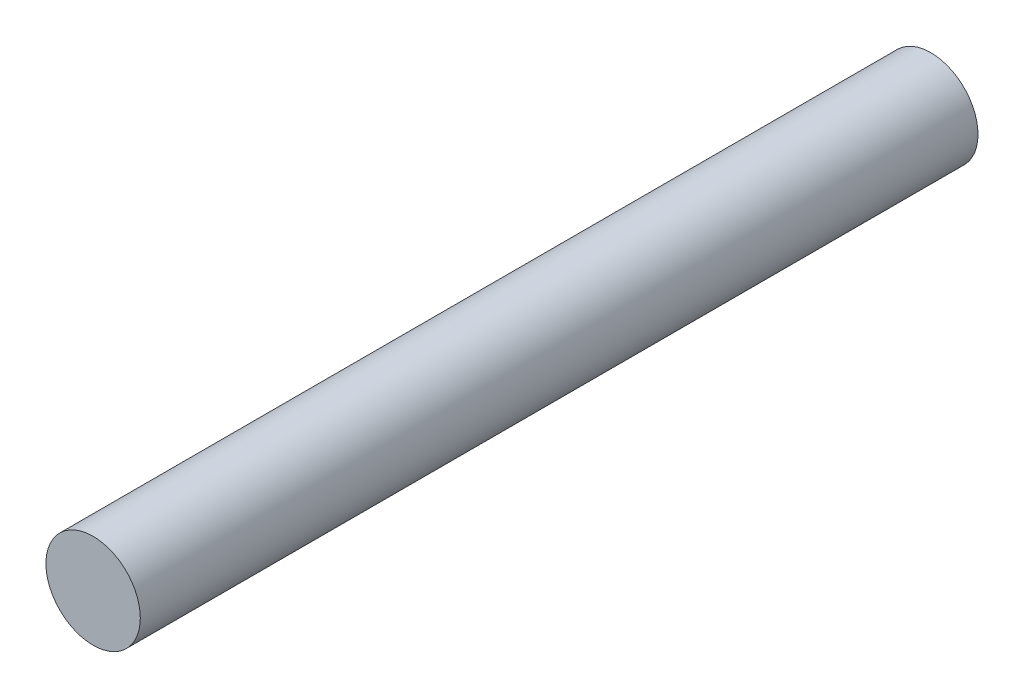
from build123d import *

# Parameters (mm, degrees)
SKETCH2_R           = 4
BOSS_EXTRUDE1_DEPTH = 71


with BuildPart() as part:
    # Sketch2 → Boss-Extrude1 (new body)
    with BuildSketch(Plane.XY):
        with Locations((-31.191376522, 8.095950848)):
            Circle(SKETCH2_R)
    extrude(amount=BOSS_EXTRUDE1_DEPTH)


solid = part.part
